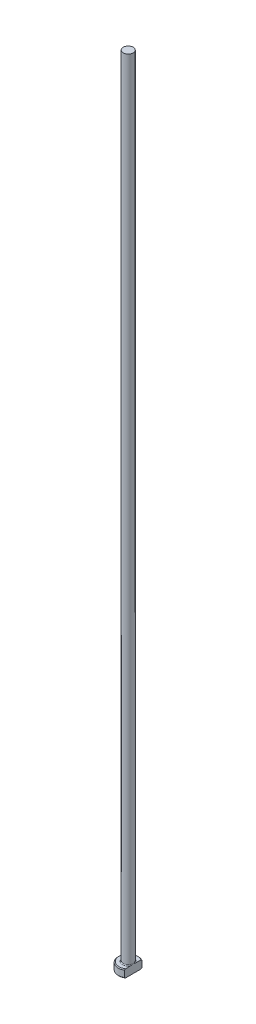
ISO-10303-21;
HEADER;
FILE_DESCRIPTION(('STEP AP214'),'2;1');
FILE_NAME('part.step','',(''),(''),'','','');
FILE_SCHEMA(('AUTOMOTIVE_DESIGN { 1 0 10303 214 1 1 1 1 }'));
ENDSEC;
DATA;
#1=APPLICATION_CONTEXT('core data for automotive mechanical design processes');
#2=APPLICATION_PROTOCOL_DEFINITION('international standard','automotive_design',2000,#1);
#3=PRODUCT_CONTEXT('',#1,'mechanical');
#4=PRODUCT('Part','Part','',(#3));
#5=PRODUCT_RELATED_PRODUCT_CATEGORY('part','',(#4));
#6=PRODUCT_DEFINITION_FORMATION('','',#4);
#7=PRODUCT_DEFINITION_CONTEXT('part definition',#1,'design');
#8=PRODUCT_DEFINITION('design','',#6,#7);
#9=PRODUCT_DEFINITION_SHAPE('','',#8);
#10=(LENGTH_UNIT() NAMED_UNIT(*) SI_UNIT(.MILLI.,.METRE.));
#11=(NAMED_UNIT(*) PLANE_ANGLE_UNIT() SI_UNIT($,.RADIAN.));
#12=(NAMED_UNIT(*) SI_UNIT($,.STERADIAN.) SOLID_ANGLE_UNIT());
#13=UNCERTAINTY_MEASURE_WITH_UNIT(LENGTH_MEASURE(1.E-05),#10,'distance_accuracy_value','');
#14=(GEOMETRIC_REPRESENTATION_CONTEXT(3) GLOBAL_UNCERTAINTY_ASSIGNED_CONTEXT((#13)) GLOBAL_UNIT_ASSIGNED_CONTEXT((#10,
#11,#12)) REPRESENTATION_CONTEXT('',''));
#15=CARTESIAN_POINT('',(0.,0.,0.));
#16=DIRECTION('',(0.,0.,1.));
#17=DIRECTION('',(1.,0.,0.));
#18=AXIS2_PLACEMENT_3D('',#15,#16,#17);
#19=CARTESIAN_POINT('',(0.,0.,0.));
#20=DIRECTION('',(0.,-1.,0.));
#21=DIRECTION('',(0.,0.,-1.));
#22=AXIS2_PLACEMENT_3D('',#19,#20,#21);
#23=PLANE('',#22);
#24=CARTESIAN_POINT('',(0.,0.,0.));
#25=DIRECTION('',(0.,-1.,0.));
#26=DIRECTION('',(0.,0.,-1.));
#27=AXIS2_PLACEMENT_3D('',#24,#25,#26);
#28=CIRCLE('',#27,2.29999999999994);
#29=CARTESIAN_POINT('',(1.24999999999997,0.,1.93067345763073));
#30=VERTEX_POINT('',#29);
#31=CARTESIAN_POINT('',(1.24999999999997,0.,-1.93067345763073));
#32=VERTEX_POINT('',#31);
#33=EDGE_CURVE('E98',#30,#32,#28,.T.);
#34=ORIENTED_EDGE('',*,*,#33,.T.);
#35=DIRECTION('',(0.,0.,1.));
#36=VECTOR('',#35,1.);
#37=CARTESIAN_POINT('',(1.24999999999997,0.,-2.16506350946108));
#38=LINE('',#37,#36);
#39=EDGE_CURVE('E83',#32,#30,#38,.T.);
#40=ORIENTED_EDGE('',*,*,#39,.T.);
#41=EDGE_LOOP('',(#34,#40));
#42=FACE_BOUND('',#41,.T.);
#43=ADVANCED_FACE('F32',(#42),#23,.T.);
#44=CARTESIAN_POINT('',(0.,259.958771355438,0.));
#45=DIRECTION('',(0.,1.,0.));
#46=DIRECTION('',(0.,0.,1.));
#47=AXIS2_PLACEMENT_3D('',#44,#45,#46);
#48=CYLINDRICAL_SURFACE('',#47,2.49999999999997);
#49=CARTESIAN_POINT('',(0.,1.80000000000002,0.));
#50=DIRECTION('',(0.,1.,0.));
#51=DIRECTION('',(0.,0.,1.));
#52=AXIS2_PLACEMENT_3D('',#49,#50,#51);
#53=CIRCLE('',#52,2.49999999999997);
#54=CARTESIAN_POINT('',(1.24999999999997,1.80000000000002,2.16506350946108));
#55=VERTEX_POINT('',#54);
#56=CARTESIAN_POINT('',(1.24999999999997,1.80000000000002,-2.16506350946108));
#57=VERTEX_POINT('',#56);
#58=EDGE_CURVE('E104',#55,#57,#53,.F.);
#59=ORIENTED_EDGE('',*,*,#58,.T.);
#60=DIRECTION('',(0.,-1.,0.));
#61=VECTOR('',#60,1.);
#62=CARTESIAN_POINT('',(1.24999999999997,200.,-2.16506350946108));
#63=LINE('',#62,#61);
#64=CARTESIAN_POINT('',(1.24999999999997,0.199999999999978,-2.16506350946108));
#65=VERTEX_POINT('',#64);
#66=EDGE_CURVE('E183',#57,#65,#63,.T.);
#67=ORIENTED_EDGE('',*,*,#66,.T.);
#68=CARTESIAN_POINT('',(0.,0.199999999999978,0.));
#69=DIRECTION('',(0.,-1.,0.));
#70=DIRECTION('',(0.,0.,-1.));
#71=AXIS2_PLACEMENT_3D('',#68,#69,#70);
#72=CIRCLE('',#71,2.49999999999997);
#73=CARTESIAN_POINT('',(1.24999999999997,0.199999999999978,2.16506350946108));
#74=VERTEX_POINT('',#73);
#75=EDGE_CURVE('E100',#65,#74,#72,.F.);
#76=ORIENTED_EDGE('',*,*,#75,.T.);
#77=DIRECTION('',(0.,-1.,0.));
#78=VECTOR('',#77,1.);
#79=CARTESIAN_POINT('',(1.24999999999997,200.,2.16506350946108));
#80=LINE('',#79,#78);
#81=EDGE_CURVE('E93',#55,#74,#80,.T.);
#82=ORIENTED_EDGE('',*,*,#81,.F.);
#83=EDGE_LOOP('',(#59,#67,#76,#82));
#84=FACE_BOUND('',#83,.T.);
#85=ADVANCED_FACE('F158',(#84),#48,.T.);
#86=CARTESIAN_POINT('',(-2.49999999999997,2.,0.));
#87=DIRECTION('',(0.,1.,0.));
#88=DIRECTION('',(0.,0.,1.));
#89=AXIS2_PLACEMENT_3D('',#86,#87,#88);
#90=PLANE('',#89);
#91=CARTESIAN_POINT('',(0.,2.,0.));
#92=DIRECTION('',(0.,1.,0.));
#93=DIRECTION('',(0.,0.,1.));
#94=AXIS2_PLACEMENT_3D('',#91,#92,#93);
#95=CIRCLE('',#94,2.3);
#96=CARTESIAN_POINT('',(1.24999999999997,2.,-1.9306734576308));
#97=VERTEX_POINT('',#96);
#98=CARTESIAN_POINT('',(1.24999999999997,2.,1.9306734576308));
#99=VERTEX_POINT('',#98);
#100=EDGE_CURVE('E178',#97,#99,#95,.T.);
#101=ORIENTED_EDGE('',*,*,#100,.T.);
#102=DIRECTION('',(0.,0.,-1.));
#103=VECTOR('',#102,1.);
#104=CARTESIAN_POINT('',(1.24999999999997,2.,0.));
#105=LINE('',#104,#103);
#106=CARTESIAN_POINT('',(1.24999999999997,1.99999999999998,0.73484692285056));
#107=VERTEX_POINT('',#106);
#108=EDGE_CURVE('E57',#99,#107,#105,.T.);
#109=ORIENTED_EDGE('',*,*,#108,.T.);
#110=CARTESIAN_POINT('',(0.,2.,0.));
#111=DIRECTION('',(0.,1.,0.));
#112=DIRECTION('',(0.,0.,1.));
#113=AXIS2_PLACEMENT_3D('',#110,#111,#112);
#114=CIRCLE('',#113,1.44999999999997);
#115=CARTESIAN_POINT('',(1.24999999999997,1.99999999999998,-0.734846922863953));
#116=VERTEX_POINT('',#115);
#117=EDGE_CURVE('E107',#107,#116,#114,.F.);
#118=ORIENTED_EDGE('',*,*,#117,.T.);
#119=EDGE_CURVE('E136',#116,#97,#105,.T.);
#120=ORIENTED_EDGE('',*,*,#119,.T.);
#121=EDGE_LOOP('',(#101,#109,#118,#120));
#122=FACE_BOUND('',#121,.T.);
#123=ADVANCED_FACE('F147',(#122),#90,.T.);
#124=CARTESIAN_POINT('',(0.,2.,0.));
#125=DIRECTION('',(0.,-1.,0.));
#126=DIRECTION('',(0.,0.,-1.));
#127=AXIS2_PLACEMENT_3D('',#124,#125,#126);
#128=CONICAL_SURFACE('',#127,2.3,0.785398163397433);
#129=ORIENTED_EDGE('',*,*,#58,.F.);
#130=CARTESIAN_POINT('',(1.24999999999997,-0.627301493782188,4.76610952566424));
#131=CARTESIAN_POINT('',(1.24999999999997,-0.522786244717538,4.6580533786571));
#132=CARTESIAN_POINT('',(1.24999999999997,-0.418383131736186,4.54988840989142));
#133=CARTESIAN_POINT('',(1.24999999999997,-0.209867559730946,4.33327605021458));
#134=CARTESIAN_POINT('',(1.24999999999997,-0.10575510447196,4.22482865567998));
#135=CARTESIAN_POINT('',(1.24999999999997,0.10216338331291,4.00753373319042));
#136=CARTESIAN_POINT('',(1.24999999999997,0.205969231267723,3.89868602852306));
#137=CARTESIAN_POINT('',(1.24999999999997,0.413121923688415,3.68055575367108));
#138=CARTESIAN_POINT('',(1.24999999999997,0.516468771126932,3.57127318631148));
#139=CARTESIAN_POINT('',(1.24999999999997,0.720522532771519,3.35432408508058));
#140=CARTESIAN_POINT('',(1.24999999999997,0.821241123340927,3.24666854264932));
#141=CARTESIAN_POINT('',(1.24999999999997,1.02192410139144,3.03065701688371));
#142=CARTESIAN_POINT('',(1.24999999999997,1.12188849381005,2.92230103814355));
#143=CARTESIAN_POINT('',(1.24999999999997,1.32077037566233,2.70467415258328));
#144=CARTESIAN_POINT('',(1.24999999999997,1.41968808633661,2.59540344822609));
#145=CARTESIAN_POINT('',(1.24999999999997,1.61608273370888,2.37557697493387));
#146=CARTESIAN_POINT('',(1.24999999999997,1.71355972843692,2.26502125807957));
#147=CARTESIAN_POINT('',(1.24999999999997,1.86911393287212,2.08515617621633));
#148=CARTESIAN_POINT('',(1.24999999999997,1.92785594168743,2.01642247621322));
#149=CARTESIAN_POINT('',(1.24999999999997,2.0442937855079,1.8780605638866));
#150=CARTESIAN_POINT('',(1.24999999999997,2.10198951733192,1.80843226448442));
#151=CARTESIAN_POINT('',(1.24999999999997,2.21658041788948,1.66728976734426));
#152=CARTESIAN_POINT('',(1.24999999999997,2.27346067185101,1.59576341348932));
#153=CARTESIAN_POINT('',(1.24999999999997,2.38522965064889,1.45118948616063));
#154=CARTESIAN_POINT('',(1.24999999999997,2.44011885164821,1.37814228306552));
#155=CARTESIAN_POINT('',(1.24999999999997,2.54788773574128,1.22886697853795));
#156=CARTESIAN_POINT('',(1.24999999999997,2.60072420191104,1.15260740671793));
#157=CARTESIAN_POINT('',(1.24999999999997,2.70212030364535,0.997098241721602));
#158=CARTESIAN_POINT('',(1.24999999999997,2.75067405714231,0.917844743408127));
#159=CARTESIAN_POINT('',(1.24999999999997,2.84043729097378,0.756494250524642));
#160=CARTESIAN_POINT('',(1.24999999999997,2.88173033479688,0.674444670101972));
#161=CARTESIAN_POINT('',(1.24999999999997,2.95366083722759,0.505835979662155));
#162=CARTESIAN_POINT('',(1.24999999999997,2.98433405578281,0.419293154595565));
#163=CARTESIAN_POINT('',(1.24999999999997,3.01753107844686,0.289507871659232));
#164=CARTESIAN_POINT('',(1.24999999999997,3.02633539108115,0.247870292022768));
#165=CARTESIAN_POINT('',(1.24999999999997,3.03997448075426,0.163937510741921));
#166=CARTESIAN_POINT('',(1.24999999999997,3.04480960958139,0.121642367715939));
#167=CARTESIAN_POINT('',(1.24999999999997,3.0501678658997,0.0369068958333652));
#168=CARTESIAN_POINT('',(1.24999999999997,3.05070431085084,-0.00553257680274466));
#169=CARTESIAN_POINT('',(1.24999999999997,3.04746162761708,-0.090246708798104));
#170=CARTESIAN_POINT('',(1.24999999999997,3.04368214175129,-0.132521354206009));
#171=CARTESIAN_POINT('',(1.24999999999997,3.03212264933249,-0.216135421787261));
#172=CARTESIAN_POINT('',(1.24999999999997,3.02437758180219,-0.257479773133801));
#173=CARTESIAN_POINT('',(1.24999999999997,3.00536735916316,-0.33935443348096));
#174=CARTESIAN_POINT('',(1.24999999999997,2.99410082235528,-0.379884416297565));
#175=CARTESIAN_POINT('',(1.24999999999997,2.96852211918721,-0.460209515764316));
#176=CARTESIAN_POINT('',(1.24999999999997,2.954193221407,-0.49999923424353));
#177=CARTESIAN_POINT('',(1.24999999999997,2.92306392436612,-0.578577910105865));
#178=CARTESIAN_POINT('',(1.24999999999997,2.90626403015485,-0.617367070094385));
#179=CARTESIAN_POINT('',(1.24999999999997,2.85269034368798,-0.732719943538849));
#180=CARTESIAN_POINT('',(1.24999999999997,2.81287978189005,-0.807869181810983));
#181=CARTESIAN_POINT('',(1.24999999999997,2.72799210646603,-0.955157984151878));
#182=CARTESIAN_POINT('',(1.24999999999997,2.68290855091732,-1.02729371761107));
#183=CARTESIAN_POINT('',(1.24999999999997,2.58903993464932,-1.16950551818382));
#184=CARTESIAN_POINT('',(1.24999999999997,2.5402409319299,-1.23957230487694));
#185=CARTESIAN_POINT('',(1.24999999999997,2.44021824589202,-1.37788366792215));
#186=CARTESIAN_POINT('',(1.24999999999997,2.38899576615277,-1.44612912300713));
#187=CARTESIAN_POINT('',(1.24999999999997,2.28411092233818,-1.58215279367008));
#188=CARTESIAN_POINT('',(1.24999999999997,2.23042529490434,-1.64991298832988));
#189=CARTESIAN_POINT('',(1.24999999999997,2.12172412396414,-1.7843605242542));
#190=CARTESIAN_POINT('',(1.24999999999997,2.06670849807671,-1.85104779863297));
#191=CARTESIAN_POINT('',(1.24999999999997,1.90044437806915,-2.04954410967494));
#192=CARTESIAN_POINT('',(1.24999999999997,1.78772044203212,-2.1801152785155));
#193=CARTESIAN_POINT('',(1.24999999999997,1.57927088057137,-2.41711311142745));
#194=CARTESIAN_POINT('',(1.24999999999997,1.48391557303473,-2.52386864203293));
#195=CARTESIAN_POINT('',(1.24999999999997,1.29202937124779,-2.73632311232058));
#196=CARTESIAN_POINT('',(1.24999999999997,1.19549844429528,-2.84202202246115));
#197=CARTESIAN_POINT('',(1.24999999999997,0.904469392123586,-3.15815976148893));
#198=CARTESIAN_POINT('',(1.24999999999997,0.708713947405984,-3.36743889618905));
#199=CARTESIAN_POINT('',(1.24999999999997,0.323382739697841,-3.77561196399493));
#200=CARTESIAN_POINT('',(1.24999999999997,0.133884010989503,-3.97457897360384));
#201=CARTESIAN_POINT('',(1.24999999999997,-0.151120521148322,-4.27209258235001));
#202=CARTESIAN_POINT('',(1.24999999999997,-0.246194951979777,-4.37105278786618));
#203=CARTESIAN_POINT('',(1.24999999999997,-0.436581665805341,-4.56874260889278));
#204=CARTESIAN_POINT('',(1.24999999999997,-0.531893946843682,-4.66747222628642));
#205=CARTESIAN_POINT('',(1.24999999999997,-0.627301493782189,-4.76610952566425));
#206=B_SPLINE_CURVE_WITH_KNOTS('',3,(#130,#131,#132,#133,#134,#135,#136,#137,#138,#139,#140,
#141,#142,#143,#144,#145,#146,#147,#148,#149,#150,#151,#152,#153,#154,#155,#156,#157,#158,#159,
#160,#161,#162,#163,#164,#165,#166,#167,#168,#169,#170,#171,#172,#173,#174,#175,#176,#177,#178,
#179,#180,#181,#182,#183,#184,#185,#186,#187,#188,#189,#190,#191,#192,#193,#194,#195,#196,#197,
#198,#199,#200,#201,#202,#203,#204,#205),.UNSPECIFIED.,.F.,.F.,(4,2,2,2,2,2,2,2,2,2,2,2,2,2,2,2,
2,2,2,2,2,2,2,2,2,2,2,2,2,2,2,2,2,2,2,2,2,4),(0.,0.450994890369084,0.901995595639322,
1.35322763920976,1.80445675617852,2.24672733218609,2.6889950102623,3.1311672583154,
3.57332164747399,3.84456018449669,4.11582532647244,4.38995864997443,4.66402597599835,
4.94225842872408,5.22086725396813,5.49602313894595,5.77024327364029,5.89775644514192,
6.02525831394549,6.15236502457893,6.27948226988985,6.40549833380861,6.531563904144,
6.65833670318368,6.78508362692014,7.03983854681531,7.2949080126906,7.55098686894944,
7.80693985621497,8.06626716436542,8.32561057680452,8.84304654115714,9.27246240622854,
9.70189024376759,10.5615524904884,11.385852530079,11.7975442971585,12.2092326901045),.UNSPECIFIED.);
#207=EDGE_CURVE('E135',#55,#99,#206,.T.);
#208=ORIENTED_EDGE('',*,*,#207,.T.);
#209=ORIENTED_EDGE('',*,*,#100,.F.);
#210=EDGE_CURVE('E127',#97,#57,#206,.T.);
#211=ORIENTED_EDGE('',*,*,#210,.T.);
#212=EDGE_LOOP('',(#129,#208,#209,#211));
#213=FACE_BOUND('',#212,.T.);
#214=ADVANCED_FACE('F143',(#213),#128,.T.);
#215=CARTESIAN_POINT('',(0.,0.199999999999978,0.));
#216=DIRECTION('',(0.,1.,0.));
#217=DIRECTION('',(0.,0.,1.));
#218=AXIS2_PLACEMENT_3D('',#215,#216,#217);
#219=CONICAL_SURFACE('',#218,2.49999999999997,0.785398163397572);
#220=ORIENTED_EDGE('',*,*,#75,.F.);
#221=CARTESIAN_POINT('',(1.24999999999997,2.62730149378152,-4.76610952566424));
#222=CARTESIAN_POINT('',(1.24999999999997,2.52278624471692,-4.65805337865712));
#223=CARTESIAN_POINT('',(1.24999999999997,2.41838313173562,-4.54988840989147));
#224=CARTESIAN_POINT('',(1.24999999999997,2.20986755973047,-4.33327605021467));
#225=CARTESIAN_POINT('',(1.24999999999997,2.10575510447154,-4.22482865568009));
#226=CARTESIAN_POINT('',(1.24999999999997,1.89783661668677,-4.00753373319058));
#227=CARTESIAN_POINT('',(1.24999999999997,1.79403076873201,-3.89868602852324));
#228=CARTESIAN_POINT('',(1.24999999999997,1.58687807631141,-3.6805557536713));
#229=CARTESIAN_POINT('',(1.24999999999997,1.48353122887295,-3.57127318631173));
#230=CARTESIAN_POINT('',(1.24999999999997,1.27947746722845,-3.35432408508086));
#231=CARTESIAN_POINT('',(1.24999999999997,1.17875887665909,-3.24666854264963));
#232=CARTESIAN_POINT('',(1.24999999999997,0.978075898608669,-3.03065701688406));
#233=CARTESIAN_POINT('',(1.24999999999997,0.878111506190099,-2.92230103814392));
#234=CARTESIAN_POINT('',(1.24999999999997,0.679229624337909,-2.70467415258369));
#235=CARTESIAN_POINT('',(1.24999999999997,0.580311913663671,-2.59540344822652));
#236=CARTESIAN_POINT('',(1.24999999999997,0.383917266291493,-2.37557697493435));
#237=CARTESIAN_POINT('',(1.24999999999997,0.286440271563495,-2.26502125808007));
#238=CARTESIAN_POINT('',(1.24999999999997,0.13088606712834,-2.08515617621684));
#239=CARTESIAN_POINT('',(1.24999999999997,0.0721440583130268,-2.01642247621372));
#240=CARTESIAN_POINT('',(1.24999999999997,-0.0442937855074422,-1.87806056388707));
#241=CARTESIAN_POINT('',(1.24999999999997,-0.10198951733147,-1.80843226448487));
#242=CARTESIAN_POINT('',(1.24999999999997,-0.216580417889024,-1.66728976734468));
#243=CARTESIAN_POINT('',(1.24999999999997,-0.273460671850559,-1.59576341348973));
#244=CARTESIAN_POINT('',(1.24999999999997,-0.385229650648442,-1.451189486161));
#245=CARTESIAN_POINT('',(1.24999999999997,-0.44011885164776,-1.37814228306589));
#246=CARTESIAN_POINT('',(1.24999999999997,-0.547887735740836,-1.22886697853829));
#247=CARTESIAN_POINT('',(1.24999999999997,-0.600724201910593,-1.15260740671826));
#248=CARTESIAN_POINT('',(1.24999999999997,-0.702120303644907,-0.997098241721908));
#249=CARTESIAN_POINT('',(1.24999999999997,-0.750674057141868,-0.917844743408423));
#250=CARTESIAN_POINT('',(1.24999999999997,-0.84043729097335,-0.756494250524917));
#251=CARTESIAN_POINT('',(1.24999999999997,-0.881730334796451,-0.674444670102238));
#252=CARTESIAN_POINT('',(1.24999999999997,-0.953660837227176,-0.505835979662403));
#253=CARTESIAN_POINT('',(1.24999999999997,-0.984334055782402,-0.419293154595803));
#254=CARTESIAN_POINT('',(1.24999999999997,-1.01753107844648,-0.289507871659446));
#255=CARTESIAN_POINT('',(1.24999999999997,-1.02633539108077,-0.247870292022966));
#256=CARTESIAN_POINT('',(1.24999999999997,-1.0399744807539,-0.163937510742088));
#257=CARTESIAN_POINT('',(1.24999999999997,-1.04480960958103,-0.12164236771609));
#258=CARTESIAN_POINT('',(1.24999999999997,-1.05016786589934,-0.0369068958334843));
#259=CARTESIAN_POINT('',(1.24999999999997,-1.05070431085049,0.00553257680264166));
#260=CARTESIAN_POINT('',(1.24999999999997,-1.04746162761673,0.0902467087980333));
#261=CARTESIAN_POINT('',(1.24999999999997,-1.04368214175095,0.132521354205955));
#262=CARTESIAN_POINT('',(1.24999999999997,-1.03212264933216,0.216135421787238));
#263=CARTESIAN_POINT('',(1.24999999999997,-1.02437758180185,0.257479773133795));
#264=CARTESIAN_POINT('',(1.24999999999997,-1.00536735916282,0.339354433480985));
#265=CARTESIAN_POINT('',(1.24999999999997,-0.99410082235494,0.379884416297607));
#266=CARTESIAN_POINT('',(1.24999999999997,-0.968522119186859,0.46020951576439));
#267=CARTESIAN_POINT('',(1.24999999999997,-0.954193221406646,0.49999923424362));
#268=CARTESIAN_POINT('',(1.24999999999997,-0.923063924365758,0.578577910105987));
#269=CARTESIAN_POINT('',(1.24999999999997,-0.906264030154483,0.617367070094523));
#270=CARTESIAN_POINT('',(1.24999999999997,-0.852690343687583,0.732719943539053));
#271=CARTESIAN_POINT('',(1.24999999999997,-0.812879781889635,0.807869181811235));
#272=CARTESIAN_POINT('',(1.24999999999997,-0.727992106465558,0.955157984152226));
#273=CARTESIAN_POINT('',(1.24999999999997,-0.682908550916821,1.02729371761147));
#274=CARTESIAN_POINT('',(1.24999999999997,-0.589039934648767,1.16950551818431));
#275=CARTESIAN_POINT('',(1.24999999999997,-0.540240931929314,1.23957230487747));
#276=CARTESIAN_POINT('',(1.24999999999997,-0.440218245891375,1.37788366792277));
#277=CARTESIAN_POINT('',(1.24999999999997,-0.388995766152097,1.4461291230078));
#278=CARTESIAN_POINT('',(1.24999999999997,-0.284110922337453,1.58215279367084));
#279=CARTESIAN_POINT('',(1.24999999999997,-0.230425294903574,1.64991298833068));
#280=CARTESIAN_POINT('',(1.24999999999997,-0.121724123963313,1.78436052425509));
#281=CARTESIAN_POINT('',(1.24999999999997,-0.0667084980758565,1.85104779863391));
#282=CARTESIAN_POINT('',(1.24999999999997,0.0995556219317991,2.04954410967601));
#283=CARTESIAN_POINT('',(1.24999999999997,0.212279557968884,2.18011527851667));
#284=CARTESIAN_POINT('',(1.24999999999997,0.420729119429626,2.41711311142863));
#285=CARTESIAN_POINT('',(1.24999999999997,0.516084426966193,2.52386864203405));
#286=CARTESIAN_POINT('',(1.24999999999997,0.70797062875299,2.73632311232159));
#287=CARTESIAN_POINT('',(1.24999999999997,0.804501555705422,2.8420220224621));
#288=CARTESIAN_POINT('',(1.24999999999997,1.09553060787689,3.1581597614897));
#289=CARTESIAN_POINT('',(1.24999999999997,1.29128605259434,3.36743889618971));
#290=CARTESIAN_POINT('',(1.24999999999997,1.67661726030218,3.77561196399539));
#291=CARTESIAN_POINT('',(1.24999999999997,1.86611598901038,3.97457897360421));
#292=CARTESIAN_POINT('',(1.24999999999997,2.151120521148,4.27209258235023));
#293=CARTESIAN_POINT('',(1.24999999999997,2.24619495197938,4.37105278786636));
#294=CARTESIAN_POINT('',(1.24999999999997,2.43658166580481,4.56874260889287));
#295=CARTESIAN_POINT('',(1.24999999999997,2.53189394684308,4.66747222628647));
#296=CARTESIAN_POINT('',(1.24999999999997,2.62730149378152,4.76610952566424));
#297=B_SPLINE_CURVE_WITH_KNOTS('',3,(#221,#222,#223,#224,#225,#226,#227,#228,#229,#230,#231,
#232,#233,#234,#235,#236,#237,#238,#239,#240,#241,#242,#243,#244,#245,#246,#247,#248,#249,#250,
#251,#252,#253,#254,#255,#256,#257,#258,#259,#260,#261,#262,#263,#264,#265,#266,#267,#268,#269,
#270,#271,#272,#273,#274,#275,#276,#277,#278,#279,#280,#281,#282,#283,#284,#285,#286,#287,#288,
#289,#290,#291,#292,#293,#294,#295,#296),.UNSPECIFIED.,.F.,.F.,(4,2,2,2,2,2,2,2,2,2,2,2,2,2,2,2,
2,2,2,2,2,2,2,2,2,2,2,2,2,2,2,2,2,2,2,2,2,4),(0.,0.450994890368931,0.901995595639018,
1.3532276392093,1.80445675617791,2.24672733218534,2.68899501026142,3.13116725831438,
3.57332164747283,3.84456018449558,4.11582532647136,4.38995864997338,4.66402597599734,
4.94225842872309,5.22086725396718,5.49602313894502,5.77024327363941,5.89775644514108,
6.0252583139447,6.15236502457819,6.27948226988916,6.40549833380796,6.5315639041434,
6.65833670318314,6.78508362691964,7.03983854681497,7.29490801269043,7.55098686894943,
7.80693985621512,8.06626716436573,8.32561057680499,8.84304654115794,9.27246240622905,
9.70189024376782,10.5615524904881,11.3858525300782,11.7975442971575,12.2092326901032),.UNSPECIFIED.);
#298=EDGE_CURVE('E86',#65,#32,#297,.T.);
#299=ORIENTED_EDGE('',*,*,#298,.T.);
#300=ORIENTED_EDGE('',*,*,#33,.F.);
#301=EDGE_CURVE('E89',#30,#74,#297,.T.);
#302=ORIENTED_EDGE('',*,*,#301,.T.);
#303=EDGE_LOOP('',(#220,#299,#300,#302));
#304=FACE_BOUND('',#303,.T.);
#305=ADVANCED_FACE('F97',(#304),#219,.T.);
#306=CARTESIAN_POINT('',(0.,2.19999999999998,0.));
#307=DIRECTION('',(0.,1.,0.));
#308=DIRECTION('',(0.,0.,1.));
#309=AXIS2_PLACEMENT_3D('',#306,#307,#308);
#310=TOROIDAL_SURFACE('',#309,1.44999999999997,0.2);
#311=CARTESIAN_POINT('',(1.24999999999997,2.19999999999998,0.));
#312=CARTESIAN_POINT('',(1.24999999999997,2.20000051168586,-1.9767961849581E-10));
#313=CARTESIAN_POINT('',(1.24999999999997,2.20000102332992,-1.08908063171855E-07));
#314=CARTESIAN_POINT('',(1.24999999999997,2.20000200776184,-4.52594759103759E-07));
#315=CARTESIAN_POINT('',(1.24999999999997,2.20000247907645,-6.90993033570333E-07));
#316=CARTESIAN_POINT('',(1.24999999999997,2.20000341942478,-1.26357942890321E-06));
#317=CARTESIAN_POINT('',(1.24999999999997,2.20000388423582,-1.60457617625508E-06));
#318=CARTESIAN_POINT('',(1.24999999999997,2.20000476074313,-2.3395489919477E-06));
#319=CARTESIAN_POINT('',(1.24999999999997,2.20000517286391,-2.7330414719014E-06));
#320=CARTESIAN_POINT('',(1.24999999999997,2.20000655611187,-4.14544010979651E-06));
#321=CARTESIAN_POINT('',(1.24999999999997,2.20000745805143,-5.23310089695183E-06));
#322=CARTESIAN_POINT('',(1.24999999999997,2.20000906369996,-7.47950358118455E-06));
#323=CARTESIAN_POINT('',(1.24999999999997,2.20000977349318,-8.63414435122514E-06));
#324=CARTESIAN_POINT('',(1.24999999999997,2.20001244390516,-1.31453476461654E-05));
#325=CARTESIAN_POINT('',(1.24999999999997,2.20001426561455,-1.65880555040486E-05));
#326=CARTESIAN_POINT('',(1.24999999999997,2.20001724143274,-2.33729028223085E-05));
#327=CARTESIAN_POINT('',(1.24999999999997,2.20001844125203,-2.66956153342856E-05));
#328=CARTESIAN_POINT('',(1.24999999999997,2.2000235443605,-4.08635084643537E-05));
#329=CARTESIAN_POINT('',(1.24999999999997,2.20002741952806,-5.17114612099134E-05));
#330=CARTESIAN_POINT('',(1.24999999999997,2.20003363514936,-7.20057670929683E-05));
#331=CARTESIAN_POINT('',(1.24999999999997,2.20003612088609,-8.14057063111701E-05));
#332=CARTESIAN_POINT('',(1.24999999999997,2.20005581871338,-0.000149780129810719));
#333=CARTESIAN_POINT('',(1.24999999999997,2.20008094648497,-0.000206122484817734));
#334=CARTESIAN_POINT('',(1.24999999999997,2.20017507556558,-0.000425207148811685));
#335=CARTESIAN_POINT('',(1.24999999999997,2.20023819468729,-0.000589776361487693));
#336=CARTESIAN_POINT('',(1.24999999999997,2.20048692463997,-0.00122878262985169));
#337=CARTESIAN_POINT('',(1.24999999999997,2.20067870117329,-0.00170134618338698));
#338=CARTESIAN_POINT('',(1.24999999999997,2.20146022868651,-0.00363636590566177));
#339=CARTESIAN_POINT('',(1.24999999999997,2.20204298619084,-0.00510090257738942));
#340=CARTESIAN_POINT('',(1.24999999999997,2.20939719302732,-0.0235712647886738));
#341=CARTESIAN_POINT('',(1.24999999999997,2.21621259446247,-0.0405643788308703));
#342=CARTESIAN_POINT('',(1.24999999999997,2.22951000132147,-0.0739606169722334));
#343=CARTESIAN_POINT('',(1.24999999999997,2.23599508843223,-0.0903626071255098));
#344=CARTESIAN_POINT('',(1.24999999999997,2.24961430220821,-0.12511129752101));
#345=CARTESIAN_POINT('',(1.24999999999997,2.25673641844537,-0.143462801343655));
#346=CARTESIAN_POINT('',(1.24999999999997,2.27085039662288,-0.180427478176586));
#347=CARTESIAN_POINT('',(1.24999999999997,2.27784022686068,-0.199041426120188));
#348=CARTESIAN_POINT('',(1.24999999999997,2.29479134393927,-0.245221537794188));
#349=CARTESIAN_POINT('',(1.24999999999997,2.30459026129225,-0.272848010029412));
#350=CARTESIAN_POINT('',(1.24999999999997,2.32310234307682,-0.327738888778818));
#351=CARTESIAN_POINT('',(1.24999999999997,2.33183568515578,-0.354996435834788));
#352=CARTESIAN_POINT('',(1.24999999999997,2.3493656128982,-0.41374417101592));
#353=CARTESIAN_POINT('',(1.24999999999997,2.35799470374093,-0.445285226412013));
#354=CARTESIAN_POINT('',(1.24999999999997,2.37338463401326,-0.509091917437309));
#355=CARTESIAN_POINT('',(1.24999999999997,2.38013036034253,-0.541361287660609));
#356=CARTESIAN_POINT('',(1.24999999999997,2.39136059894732,-0.608339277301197));
#357=CARTESIAN_POINT('',(1.24999999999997,2.39568167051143,-0.643076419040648));
#358=CARTESIAN_POINT('',(1.24999999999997,2.40037605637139,-0.712733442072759));
#359=CARTESIAN_POINT('',(1.24999999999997,2.40076553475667,-0.747651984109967));
#360=CARTESIAN_POINT('',(1.24999999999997,2.39677668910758,-0.8081037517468));
#361=CARTESIAN_POINT('',(1.24999999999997,2.39361441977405,-0.833711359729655));
#362=CARTESIAN_POINT('',(1.24999999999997,2.38355990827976,-0.883915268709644));
#363=CARTESIAN_POINT('',(1.24999999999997,2.37671813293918,-0.908520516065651));
#364=CARTESIAN_POINT('',(1.24999999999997,2.36252570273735,-0.944879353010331));
#365=CARTESIAN_POINT('',(1.24999999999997,2.35688428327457,-0.957298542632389));
#366=CARTESIAN_POINT('',(1.24999999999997,2.34399066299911,-0.981318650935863));
#367=CARTESIAN_POINT('',(1.24999999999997,2.33673636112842,-0.992918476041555));
#368=CARTESIAN_POINT('',(1.24999999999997,2.32199744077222,-1.01267533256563));
#369=CARTESIAN_POINT('',(1.24999999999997,2.31482723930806,-1.02106482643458));
#370=CARTESIAN_POINT('',(1.24999999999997,2.29924321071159,-1.03659690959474));
#371=CARTESIAN_POINT('',(1.24999999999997,2.29083198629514,-1.04374204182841));
#372=CARTESIAN_POINT('',(1.24999999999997,2.27498600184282,-1.05478694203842));
#373=CARTESIAN_POINT('',(1.24999999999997,2.26780814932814,-1.05905359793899));
#374=CARTESIAN_POINT('',(1.24999999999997,2.25284782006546,-1.06635953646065));
#375=CARTESIAN_POINT('',(1.24999999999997,2.24506572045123,-1.06939957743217));
#376=CARTESIAN_POINT('',(1.24999999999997,2.22901828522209,-1.07404931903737));
#377=CARTESIAN_POINT('',(1.24999999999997,2.22074990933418,-1.07564870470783));
#378=CARTESIAN_POINT('',(1.24999999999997,2.20405985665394,-1.07723717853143));
#379=CARTESIAN_POINT('',(1.24999999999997,2.19563825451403,-1.07722703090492));
#380=CARTESIAN_POINT('',(1.24999999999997,2.17988128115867,-1.07569157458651));
#381=CARTESIAN_POINT('',(1.24999999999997,2.17252879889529,-1.0743339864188));
#382=CARTESIAN_POINT('',(1.24999999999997,2.15814333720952,-1.07044616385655));
#383=CARTESIAN_POINT('',(1.24999999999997,2.15111040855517,-1.06791574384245));
#384=CARTESIAN_POINT('',(1.24999999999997,2.13724955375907,-1.06171920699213));
#385=CARTESIAN_POINT('',(1.24999999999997,2.13043935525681,-1.05801386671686));
#386=CARTESIAN_POINT('',(1.24999999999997,2.11740316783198,-1.04969609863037));
#387=CARTESIAN_POINT('',(1.24999999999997,2.11117742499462,-1.04508329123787));
#388=CARTESIAN_POINT('',(1.24999999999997,2.09586196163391,-1.03220341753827));
#389=CARTESIAN_POINT('',(1.24999999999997,2.08723799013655,-1.02338140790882));
#390=CARTESIAN_POINT('',(1.24999999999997,2.07148817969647,-1.00448021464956));
#391=CARTESIAN_POINT('',(1.24999999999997,2.0643671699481,-0.994397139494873));
#392=CARTESIAN_POINT('',(1.24999999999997,2.04800089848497,-0.967694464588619));
#393=CARTESIAN_POINT('',(1.24999999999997,2.0397014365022,-0.950498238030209));
#394=CARTESIAN_POINT('',(1.24999999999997,2.02582422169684,-0.915117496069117));
#395=CARTESIAN_POINT('',(1.24999999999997,2.02024415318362,-0.896933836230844));
#396=CARTESIAN_POINT('',(1.24999999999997,2.00805724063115,-0.846781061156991));
#397=CARTESIAN_POINT('',(1.24999999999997,2.00359525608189,-0.8142976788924));
#398=CARTESIAN_POINT('',(1.24999999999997,1.99933348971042,-0.748574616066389));
#399=CARTESIAN_POINT('',(1.24999999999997,1.99961552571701,-0.715331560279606));
#400=CARTESIAN_POINT('',(1.24999999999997,2.00446632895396,-0.637920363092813));
#401=CARTESIAN_POINT('',(1.24999999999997,2.01044886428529,-0.593849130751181));
#402=CARTESIAN_POINT('',(1.24999999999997,2.02681929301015,-0.506401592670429));
#403=CARTESIAN_POINT('',(1.24999999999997,2.03722697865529,-0.463029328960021));
#404=CARTESIAN_POINT('',(1.24999999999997,2.06007158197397,-0.380638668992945));
#405=CARTESIAN_POINT('',(1.24999999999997,2.07227412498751,-0.34155342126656));
#406=CARTESIAN_POINT('',(1.24999999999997,2.09824323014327,-0.264347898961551));
#407=CARTESIAN_POINT('',(1.24999999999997,2.11199311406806,-0.226221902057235));
#408=CARTESIAN_POINT('',(1.24999999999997,2.13108825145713,-0.175350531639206));
#409=CARTESIAN_POINT('',(1.24999999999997,2.13599999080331,-0.16243890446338));
#410=CARTESIAN_POINT('',(1.24999999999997,2.14604281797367,-0.13631825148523));
#411=CARTESIAN_POINT('',(1.24999999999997,2.15117629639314,-0.123110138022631));
#412=CARTESIAN_POINT('',(1.24999999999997,2.16341702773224,-0.0918425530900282));
#413=CARTESIAN_POINT('',(1.24999999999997,2.17055250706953,-0.0737943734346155));
#414=CARTESIAN_POINT('',(1.24999999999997,2.18426943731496,-0.0393586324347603));
#415=CARTESIAN_POINT('',(1.24999999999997,2.19084281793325,-0.0229681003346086));
#416=CARTESIAN_POINT('',(1.24999999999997,2.19795564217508,-0.00510438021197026));
#417=CARTESIAN_POINT('',(1.24999999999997,2.19853702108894,-0.00364331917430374));
#418=CARTESIAN_POINT('',(1.24999999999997,2.19931818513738,-0.00170914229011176));
#419=CARTESIAN_POINT('',(1.24999999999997,2.19951102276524,-0.00123396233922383));
#420=CARTESIAN_POINT('',(1.24999999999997,2.19976104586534,-0.000591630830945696));
#421=CARTESIAN_POINT('',(1.24999999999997,2.19982443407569,-0.000426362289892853));
#422=CARTESIAN_POINT('',(1.24999999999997,2.1999189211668,-0.000206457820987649));
#423=CARTESIAN_POINT('',(1.24999999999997,2.19994410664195,-0.000149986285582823));
#424=CARTESIAN_POINT('',(1.24999999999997,2.19996383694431,-8.1464748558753E-05));
#425=CARTESIAN_POINT('',(1.24999999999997,2.19996632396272,-7.20551566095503E-05));
#426=CARTESIAN_POINT('',(1.24999999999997,2.19997254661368,-5.17396175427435E-05));
#427=CARTESIAN_POINT('',(1.24999999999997,2.19997642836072,-4.08803462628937E-05));
#428=CARTESIAN_POINT('',(1.24999999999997,2.19998153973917,-2.66997572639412E-05));
#429=CARTESIAN_POINT('',(1.24999999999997,2.1999827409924,-2.33755457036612E-05));
#430=CARTESIAN_POINT('',(1.24999999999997,2.19998572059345,-1.65878757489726E-05));
#431=CARTESIAN_POINT('',(1.24999999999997,2.19998754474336,-1.31438993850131E-05));
#432=CARTESIAN_POINT('',(1.24999999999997,2.19999021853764,-8.63150510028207E-06));
#433=CARTESIAN_POINT('',(1.24999999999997,2.19999092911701,-7.47674879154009E-06));
#434=CARTESIAN_POINT('',(1.24999999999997,2.19999253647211,-5.23027079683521E-06));
#435=CARTESIAN_POINT('',(1.24999999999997,2.19999343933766,-4.14265820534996E-06));
#436=CARTESIAN_POINT('',(1.24999999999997,2.19999482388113,-2.73051190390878E-06));
#437=CARTESIAN_POINT('',(1.24999999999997,2.19999523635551,-2.33712918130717E-06));
#438=CARTESIAN_POINT('',(1.24999999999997,2.19999611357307,-1.60243917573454E-06));
#439=CARTESIAN_POINT('',(1.24999999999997,2.19999657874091,-1.26161620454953E-06));
#440=CARTESIAN_POINT('',(1.24999999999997,2.19999751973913,-6.89449591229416E-07));
#441=CARTESIAN_POINT('',(1.24999999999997,2.19999799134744,-4.51288697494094E-07));
#442=CARTESIAN_POINT('',(1.24999999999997,2.19999897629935,-1.08178109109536E-07));
#443=CARTESIAN_POINT('',(1.24999999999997,2.19999948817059,1.97735059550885E-10));
#444=CARTESIAN_POINT('',(1.24999999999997,2.19999999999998,0.));
#445=B_SPLINE_CURVE_WITH_KNOTS('',3,(#311,#312,#313,#314,#315,#316,#317,#318,#319,#320,#321,
#322,#323,#324,#325,#326,#327,#328,#329,#330,#331,#332,#333,#334,#335,#336,#337,#338,#339,#340,
#341,#342,#343,#344,#345,#346,#347,#348,#349,#350,#351,#352,#353,#354,#355,#356,#357,#358,#359,
#360,#361,#362,#363,#364,#365,#366,#367,#368,#369,#370,#371,#372,#373,#374,#375,#376,#377,#378,
#379,#380,#381,#382,#383,#384,#385,#386,#387,#388,#389,#390,#391,#392,#393,#394,#395,#396,#397,
#398,#399,#400,#401,#402,#403,#404,#405,#406,#407,#408,#409,#410,#411,#412,#413,#414,#415,#416,
#417,#418,#419,#420,#421,#422,#423,#424,#425,#426,#427,#428,#429,#430,#431,#432,#433,#434,#435,
#436,#437,#438,#439,#440,#441,#442,#443,#444),.UNSPECIFIED.,.T.,.F.,(4,2,2,2,2,2,2,2,2,2,2,2,2,
2,2,2,2,2,2,2,2,2,2,2,2,2,2,2,2,2,2,2,2,2,2,2,2,2,2,2,2,2,2,2,2,2,2,2,2,2,2,2,2,2,2,2,2,2,2,2,2,
2,2,2,2,2,4),(0.,1.53427576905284E-06,3.11115061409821E-06,4.83351643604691E-06,
6.54098955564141E-06,1.07594295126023E-05,1.48222852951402E-05,2.64707315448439E-05,
3.70576290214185E-05,7.16088727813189E-05,0.000100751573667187,0.000285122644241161,
0.000814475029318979,0.00234373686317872,0.00707317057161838,0.061994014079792,
0.114907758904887,0.173961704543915,0.233609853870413,0.321537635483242,0.407388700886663,
0.505443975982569,0.604264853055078,0.709126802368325,0.813557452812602,0.890773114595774,
0.966955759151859,1.00778845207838,1.04867465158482,1.08167318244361,1.1146034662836,
1.13955805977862,1.16449720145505,1.18961351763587,1.21471790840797,1.23704542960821,
1.25937648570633,1.28254952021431,1.30573226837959,1.34253218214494,1.37944859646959,
1.43640829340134,1.4933194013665,1.59113685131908,1.69064301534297,1.82371118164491,
1.9573808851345,2.08016146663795,2.20172662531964,2.24316968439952,2.28568093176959,
2.34390494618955,2.39687801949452,2.40159623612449,2.40313396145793,2.40366556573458,
2.40385035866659,2.40387953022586,2.40391411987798,2.40392471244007,2.40393636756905,
2.4039404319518,2.40394465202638,2.40394636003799,2.4039480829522,2.40394966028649,
2.40395119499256),.UNSPECIFIED.);
#446=CARTESIAN_POINT('',(1.24999999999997,2.19999999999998,0.));
#447=VERTEX_POINT('',#446);
#448=EDGE_CURVE('E11',#116,#447,#445,.T.);
#449=ORIENTED_EDGE('',*,*,#448,.F.);
#450=ORIENTED_EDGE('',*,*,#117,.F.);
#451=CARTESIAN_POINT('',(1.24999999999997,2.19999999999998,0.));
#452=CARTESIAN_POINT('',(1.24999999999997,2.1999994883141,1.97679627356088E-10));
#453=CARTESIAN_POINT('',(1.24999999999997,2.19999897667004,1.08908063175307E-07));
#454=CARTESIAN_POINT('',(1.24999999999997,2.19999799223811,4.52594759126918E-07));
#455=CARTESIAN_POINT('',(1.24999999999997,2.19999752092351,6.90993033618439E-07));
#456=CARTESIAN_POINT('',(1.24999999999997,2.19999658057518,1.26357942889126E-06));
#457=CARTESIAN_POINT('',(1.24999999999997,2.19999611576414,1.60457617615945E-06));
#458=CARTESIAN_POINT('',(1.24999999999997,2.19999523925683,2.33954899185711E-06));
#459=CARTESIAN_POINT('',(1.24999999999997,2.19999482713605,2.73304147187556E-06));
#460=CARTESIAN_POINT('',(1.24999999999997,2.19999344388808,4.14544010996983E-06));
#461=CARTESIAN_POINT('',(1.24999999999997,2.19999254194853,5.23310089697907E-06));
#462=CARTESIAN_POINT('',(1.24999999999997,2.1999909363,7.47950358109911E-06));
#463=CARTESIAN_POINT('',(1.24999999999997,2.19999022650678,8.63414435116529E-06));
#464=CARTESIAN_POINT('',(1.24999999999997,2.1999875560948,1.3145347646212E-05));
#465=CARTESIAN_POINT('',(1.24999999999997,2.19998573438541,1.65880555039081E-05));
#466=CARTESIAN_POINT('',(1.24999999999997,2.19998275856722,2.33729028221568E-05));
#467=CARTESIAN_POINT('',(1.24999999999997,2.19998155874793,2.66956153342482E-05));
#468=CARTESIAN_POINT('',(1.24999999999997,2.19997645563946,4.08635084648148E-05));
#469=CARTESIAN_POINT('',(1.24999999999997,2.1999725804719,5.1711461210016E-05));
#470=CARTESIAN_POINT('',(1.24999999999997,2.1999663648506,7.2005767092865E-05));
#471=CARTESIAN_POINT('',(1.24999999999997,2.19996387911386,8.14057063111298E-05));
#472=CARTESIAN_POINT('',(1.24999999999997,2.19994418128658,0.000149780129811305));
#473=CARTESIAN_POINT('',(1.24999999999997,2.19991905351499,0.000206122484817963));
#474=CARTESIAN_POINT('',(1.24999999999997,2.19982492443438,0.000425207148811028));
#475=CARTESIAN_POINT('',(1.24999999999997,2.19976180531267,0.000589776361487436));
#476=CARTESIAN_POINT('',(1.24999999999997,2.19951307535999,0.00122878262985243));
#477=CARTESIAN_POINT('',(1.24999999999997,2.19932129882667,0.00170134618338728));
#478=CARTESIAN_POINT('',(1.24999999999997,2.19853977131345,0.00363636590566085));
#479=CARTESIAN_POINT('',(1.24999999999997,2.19795701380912,0.00510090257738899));
#480=CARTESIAN_POINT('',(1.24999999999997,2.19060280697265,0.0235712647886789));
#481=CARTESIAN_POINT('',(1.24999999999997,2.18378740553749,0.0405643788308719));
#482=CARTESIAN_POINT('',(1.24999999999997,2.17048999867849,0.0739606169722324));
#483=CARTESIAN_POINT('',(1.24999999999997,2.16400491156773,0.0903626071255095));
#484=CARTESIAN_POINT('',(1.24999999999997,2.15038569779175,0.125111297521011));
#485=CARTESIAN_POINT('',(1.24999999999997,2.14326358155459,0.143462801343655));
#486=CARTESIAN_POINT('',(1.24999999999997,2.12914960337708,0.180427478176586));
#487=CARTESIAN_POINT('',(1.24999999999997,2.12215977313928,0.199041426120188));
#488=CARTESIAN_POINT('',(1.24999999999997,2.10520865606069,0.245221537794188));
#489=CARTESIAN_POINT('',(1.24999999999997,2.09540973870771,0.272848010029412));
#490=CARTESIAN_POINT('',(1.24999999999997,2.07689765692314,0.327738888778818));
#491=CARTESIAN_POINT('',(1.24999999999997,2.06816431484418,0.354996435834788));
#492=CARTESIAN_POINT('',(1.24999999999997,2.05063438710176,0.41374417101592));
#493=CARTESIAN_POINT('',(1.24999999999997,2.04200529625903,0.445285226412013));
#494=CARTESIAN_POINT('',(1.24999999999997,2.0266153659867,0.509091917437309));
#495=CARTESIAN_POINT('',(1.24999999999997,2.01986963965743,0.541361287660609));
#496=CARTESIAN_POINT('',(1.24999999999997,2.00863940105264,0.608339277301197));
#497=CARTESIAN_POINT('',(1.24999999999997,2.00431832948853,0.643076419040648));
#498=CARTESIAN_POINT('',(1.24999999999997,1.99962394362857,0.712733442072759));
#499=CARTESIAN_POINT('',(1.24999999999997,1.99923446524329,0.747651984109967));
#500=CARTESIAN_POINT('',(1.24999999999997,2.00322331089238,0.8081037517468));
#501=CARTESIAN_POINT('',(1.24999999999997,2.00638558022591,0.833711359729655));
#502=CARTESIAN_POINT('',(1.24999999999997,2.0164400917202,0.883915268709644));
#503=CARTESIAN_POINT('',(1.24999999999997,2.02328186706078,0.908520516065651));
#504=CARTESIAN_POINT('',(1.24999999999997,2.03747429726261,0.944879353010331));
#505=CARTESIAN_POINT('',(1.24999999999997,2.04311571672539,0.957298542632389));
#506=CARTESIAN_POINT('',(1.24999999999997,2.05600933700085,0.981318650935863));
#507=CARTESIAN_POINT('',(1.24999999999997,2.06326363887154,0.992918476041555));
#508=CARTESIAN_POINT('',(1.24999999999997,2.07800255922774,1.01267533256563));
#509=CARTESIAN_POINT('',(1.24999999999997,2.0851727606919,1.02106482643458));
#510=CARTESIAN_POINT('',(1.24999999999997,2.10075678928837,1.03659690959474));
#511=CARTESIAN_POINT('',(1.24999999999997,2.10916801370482,1.04374204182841));
#512=CARTESIAN_POINT('',(1.24999999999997,2.12501399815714,1.05478694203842));
#513=CARTESIAN_POINT('',(1.24999999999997,2.13219185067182,1.05905359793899));
#514=CARTESIAN_POINT('',(1.24999999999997,2.1471521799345,1.06635953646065));
#515=CARTESIAN_POINT('',(1.24999999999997,2.15493427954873,1.06939957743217));
#516=CARTESIAN_POINT('',(1.24999999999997,2.17098171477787,1.07404931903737));
#517=CARTESIAN_POINT('',(1.24999999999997,2.17925009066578,1.07564870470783));
#518=CARTESIAN_POINT('',(1.24999999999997,2.19594014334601,1.07723717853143));
#519=CARTESIAN_POINT('',(1.24999999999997,2.20436174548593,1.07722703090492));
#520=CARTESIAN_POINT('',(1.24999999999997,2.22011871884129,1.07569157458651));
#521=CARTESIAN_POINT('',(1.24999999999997,2.22747120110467,1.0743339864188));
#522=CARTESIAN_POINT('',(1.24999999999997,2.24185666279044,1.07044616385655));
#523=CARTESIAN_POINT('',(1.24999999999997,2.24888959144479,1.06791574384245));
#524=CARTESIAN_POINT('',(1.24999999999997,2.26275044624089,1.06171920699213));
#525=CARTESIAN_POINT('',(1.24999999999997,2.26956064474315,1.05801386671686));
#526=CARTESIAN_POINT('',(1.24999999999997,2.28259683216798,1.04969609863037));
#527=CARTESIAN_POINT('',(1.24999999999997,2.28882257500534,1.04508329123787));
#528=CARTESIAN_POINT('',(1.24999999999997,2.30413803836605,1.03220341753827));
#529=CARTESIAN_POINT('',(1.24999999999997,2.31276200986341,1.02338140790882));
#530=CARTESIAN_POINT('',(1.24999999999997,2.32851182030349,1.00448021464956));
#531=CARTESIAN_POINT('',(1.24999999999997,2.33563283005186,0.994397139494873));
#532=CARTESIAN_POINT('',(1.24999999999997,2.35199910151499,0.967694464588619));
#533=CARTESIAN_POINT('',(1.24999999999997,2.36029856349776,0.950498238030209));
#534=CARTESIAN_POINT('',(1.24999999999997,2.37417577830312,0.915117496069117));
#535=CARTESIAN_POINT('',(1.24999999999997,2.37975584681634,0.896933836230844));
#536=CARTESIAN_POINT('',(1.24999999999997,2.3919427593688,0.846781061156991));
#537=CARTESIAN_POINT('',(1.24999999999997,2.39640474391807,0.8142976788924));
#538=CARTESIAN_POINT('',(1.24999999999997,2.40066651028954,0.748574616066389));
#539=CARTESIAN_POINT('',(1.24999999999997,2.40038447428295,0.715331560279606));
#540=CARTESIAN_POINT('',(1.24999999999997,2.395533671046,0.637920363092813));
#541=CARTESIAN_POINT('',(1.24999999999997,2.38955113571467,0.593849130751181));
#542=CARTESIAN_POINT('',(1.24999999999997,2.3731807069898,0.506401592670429));
#543=CARTESIAN_POINT('',(1.24999999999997,2.36277302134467,0.463029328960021));
#544=CARTESIAN_POINT('',(1.24999999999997,2.33992841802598,0.380638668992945));
#545=CARTESIAN_POINT('',(1.24999999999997,2.32772587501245,0.34155342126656));
#546=CARTESIAN_POINT('',(1.24999999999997,2.30175676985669,0.264347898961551));
#547=CARTESIAN_POINT('',(1.24999999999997,2.2880068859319,0.226221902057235));
#548=CARTESIAN_POINT('',(1.24999999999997,2.26891174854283,0.175350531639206));
#549=CARTESIAN_POINT('',(1.24999999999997,2.26400000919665,0.162438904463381));
#550=CARTESIAN_POINT('',(1.24999999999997,2.25395718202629,0.13631825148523));
#551=CARTESIAN_POINT('',(1.24999999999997,2.24882370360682,0.123110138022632));
#552=CARTESIAN_POINT('',(1.24999999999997,2.23658297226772,0.091842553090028));
#553=CARTESIAN_POINT('',(1.24999999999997,2.22944749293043,0.0737943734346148));
#554=CARTESIAN_POINT('',(1.24999999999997,2.215730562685,0.0393586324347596));
#555=CARTESIAN_POINT('',(1.24999999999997,2.20915718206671,0.0229681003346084));
#556=CARTESIAN_POINT('',(1.24999999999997,2.20204435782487,0.00510438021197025));
#557=CARTESIAN_POINT('',(1.24999999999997,2.20146297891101,0.00364331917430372));
#558=CARTESIAN_POINT('',(1.24999999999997,2.20068181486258,0.00170914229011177));
#559=CARTESIAN_POINT('',(1.24999999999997,2.20048897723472,0.00123396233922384));
#560=CARTESIAN_POINT('',(1.24999999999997,2.20023895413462,0.000591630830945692));
#561=CARTESIAN_POINT('',(1.24999999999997,2.20017556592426,0.000426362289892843));
#562=CARTESIAN_POINT('',(1.24999999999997,2.20008107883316,0.000206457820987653));
#563=CARTESIAN_POINT('',(1.24999999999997,2.20005589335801,0.000149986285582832));
#564=CARTESIAN_POINT('',(1.24999999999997,2.20003616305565,8.14647485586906E-05));
#565=CARTESIAN_POINT('',(1.24999999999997,2.20003367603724,7.20551566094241E-05));
#566=CARTESIAN_POINT('',(1.24999999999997,2.20002745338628,5.17396175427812E-05));
#567=CARTESIAN_POINT('',(1.24999999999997,2.20002357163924,4.08803462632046E-05));
#568=CARTESIAN_POINT('',(1.24999999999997,2.20001846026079,2.66997572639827E-05));
#569=CARTESIAN_POINT('',(1.24999999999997,2.20001725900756,2.33755457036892E-05));
#570=CARTESIAN_POINT('',(1.24999999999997,2.20001427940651,1.65878757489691E-05));
#571=CARTESIAN_POINT('',(1.24999999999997,2.2000124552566,1.31438993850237E-05));
#572=CARTESIAN_POINT('',(1.24999999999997,2.20000978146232,8.63150510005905E-06));
#573=CARTESIAN_POINT('',(1.24999999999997,2.20000907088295,7.47674879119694E-06));
#574=CARTESIAN_POINT('',(1.24999999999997,2.20000746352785,5.23027079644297E-06));
#575=CARTESIAN_POINT('',(1.24999999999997,2.2000065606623,4.14265820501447E-06));
#576=CARTESIAN_POINT('',(1.24999999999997,2.20000517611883,2.7305119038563E-06));
#577=CARTESIAN_POINT('',(1.24999999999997,2.20000476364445,2.33712918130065E-06));
#578=CARTESIAN_POINT('',(1.24999999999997,2.20000388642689,1.60243917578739E-06));
#579=CARTESIAN_POINT('',(1.24999999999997,2.20000342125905,1.26161620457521E-06));
#580=CARTESIAN_POINT('',(1.24999999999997,2.20000248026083,6.89449591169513E-07));
#581=CARTESIAN_POINT('',(1.24999999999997,2.20000200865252,4.51288697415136E-07));
#582=CARTESIAN_POINT('',(1.24999999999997,2.20000102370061,1.0817810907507E-07));
#583=CARTESIAN_POINT('',(1.24999999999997,2.20000051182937,-1.97735068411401E-10));
#584=CARTESIAN_POINT('',(1.24999999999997,2.19999999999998,0.));
#585=B_SPLINE_CURVE_WITH_KNOTS('',3,(#451,#452,#453,#454,#455,#456,#457,#458,#459,#460,#461,
#462,#463,#464,#465,#466,#467,#468,#469,#470,#471,#472,#473,#474,#475,#476,#477,#478,#479,#480,
#481,#482,#483,#484,#485,#486,#487,#488,#489,#490,#491,#492,#493,#494,#495,#496,#497,#498,#499,
#500,#501,#502,#503,#504,#505,#506,#507,#508,#509,#510,#511,#512,#513,#514,#515,#516,#517,#518,
#519,#520,#521,#522,#523,#524,#525,#526,#527,#528,#529,#530,#531,#532,#533,#534,#535,#536,#537,
#538,#539,#540,#541,#542,#543,#544,#545,#546,#547,#548,#549,#550,#551,#552,#553,#554,#555,#556,
#557,#558,#559,#560,#561,#562,#563,#564,#565,#566,#567,#568,#569,#570,#571,#572,#573,#574,#575,
#576,#577,#578,#579,#580,#581,#582,#583,#584),.UNSPECIFIED.,.T.,.F.,(4,2,2,2,2,2,2,2,2,2,2,2,2,
2,2,2,2,2,2,2,2,2,2,2,2,2,2,2,2,2,2,2,2,2,2,2,2,2,2,2,2,2,2,2,2,2,2,2,2,2,2,2,2,2,2,2,2,2,2,2,2,
2,2,2,2,2,4),(0.,1.53427576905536E-06,3.11115061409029E-06,4.83351643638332E-06,
6.54098955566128E-06,1.07594295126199E-05,1.48222852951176E-05,2.64707315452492E-05,
3.7057629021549E-05,7.16088727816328E-05,0.000100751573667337,0.000285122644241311,
0.00081447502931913,0.00234373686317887,0.00707317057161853,0.0619940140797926,
0.114907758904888,0.173961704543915,0.233609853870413,0.321537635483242,0.407388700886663,
0.50544397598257,0.604264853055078,0.709126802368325,0.813557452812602,0.890773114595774,
0.966955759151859,1.00778845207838,1.04867465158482,1.08167318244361,1.1146034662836,
1.13955805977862,1.16449720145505,1.18961351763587,1.21471790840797,1.23704542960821,
1.25937648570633,1.28254952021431,1.30573226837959,1.34253218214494,1.37944859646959,
1.43640829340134,1.4933194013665,1.59113685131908,1.69064301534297,1.82371118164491,
1.9573808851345,2.08016146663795,2.20172662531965,2.24316968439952,2.28568093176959,
2.34390494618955,2.39687801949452,2.40159623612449,2.40313396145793,2.40366556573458,
2.40385035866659,2.40387953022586,2.40391411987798,2.40392471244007,2.40393636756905,
2.40394043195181,2.40394465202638,2.40394636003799,2.4039480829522,2.40394966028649,
2.40395119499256),.UNSPECIFIED.);
#586=EDGE_CURVE('E46',#447,#107,#585,.T.);
#587=ORIENTED_EDGE('',*,*,#586,.F.);
#588=CARTESIAN_POINT('',(0.,2.19999999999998,0.));
#589=DIRECTION('',(0.,1.,0.));
#590=DIRECTION('',(0.,0.,1.));
#591=AXIS2_PLACEMENT_3D('',#588,#589,#590);
#592=CIRCLE('',#591,1.24999999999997);
#593=EDGE_CURVE('E103',#447,#447,#592,.T.);
#594=ORIENTED_EDGE('',*,*,#593,.F.);
#595=EDGE_LOOP('',(#449,#450,#587,#594));
#596=FACE_BOUND('',#595,.T.);
#597=ADVANCED_FACE('F34',(#596),#310,.F.);
#598=CARTESIAN_POINT('',(0.,259.958771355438,0.));
#599=DIRECTION('',(0.,1.,0.));
#600=DIRECTION('',(0.,0.,1.));
#601=AXIS2_PLACEMENT_3D('',#598,#599,#600);
#602=CYLINDRICAL_SURFACE('',#601,1.24999999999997);
#603=ORIENTED_EDGE('',*,*,#593,.T.);
#604=EDGE_LOOP('',(#603));
#605=FACE_BOUND('',#604,.T.);
#606=CARTESIAN_POINT('',(0.,200.,0.));
#607=DIRECTION('',(0.,1.,0.));
#608=DIRECTION('',(0.,0.,1.));
#609=AXIS2_PLACEMENT_3D('',#606,#607,#608);
#610=CIRCLE('',#609,1.24999999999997);
#611=CARTESIAN_POINT('',(0.,200.,1.24999999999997));
#612=VERTEX_POINT('',#611);
#613=EDGE_CURVE('E101',#612,#612,#610,.T.);
#614=ORIENTED_EDGE('',*,*,#613,.F.);
#615=EDGE_LOOP('',(#614));
#616=FACE_BOUND('',#615,.T.);
#617=ADVANCED_FACE('F155',(#605,#616),#602,.T.);
#618=CARTESIAN_POINT('',(-1.24999999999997,200.,0.));
#619=DIRECTION('',(0.,1.,0.));
#620=DIRECTION('',(0.,0.,1.));
#621=AXIS2_PLACEMENT_3D('',#618,#619,#620);
#622=PLANE('',#621);
#623=ORIENTED_EDGE('',*,*,#613,.T.);
#624=EDGE_LOOP('',(#623));
#625=FACE_BOUND('',#624,.T.);
#626=ADVANCED_FACE('F121',(#625),#622,.T.);
#627=CARTESIAN_POINT('',(1.24999999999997,200.,-2.16506350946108));
#628=DIRECTION('',(1.,0.,0.));
#629=DIRECTION('',(0.,0.,-1.));
#630=AXIS2_PLACEMENT_3D('',#627,#628,#629);
#631=PLANE('',#630);
#632=ORIENTED_EDGE('',*,*,#66,.F.);
#633=ORIENTED_EDGE('',*,*,#210,.F.);
#634=ORIENTED_EDGE('',*,*,#119,.F.);
#635=ORIENTED_EDGE('',*,*,#448,.T.);
#636=ORIENTED_EDGE('',*,*,#586,.T.);
#637=ORIENTED_EDGE('',*,*,#108,.F.);
#638=ORIENTED_EDGE('',*,*,#207,.F.);
#639=ORIENTED_EDGE('',*,*,#81,.T.);
#640=ORIENTED_EDGE('',*,*,#301,.F.);
#641=ORIENTED_EDGE('',*,*,#39,.F.);
#642=ORIENTED_EDGE('',*,*,#298,.F.);
#643=EDGE_LOOP('',(#632,#633,#634,#635,#636,#637,#638,#639,#640,#641,#642));
#644=FACE_BOUND('',#643,.T.);
#645=ADVANCED_FACE('F85',(#644),#631,.T.);
#646=CLOSED_SHELL('',(#43,#85,#123,#214,#305,#597,#617,#626,#645));
#647=MANIFOLD_SOLID_BREP('B2',#646);
#648=ADVANCED_BREP_SHAPE_REPRESENTATION('',(#18,#647),#14);
#649=SHAPE_DEFINITION_REPRESENTATION(#9,#648);
ENDSEC;
END-ISO-10303-21;
